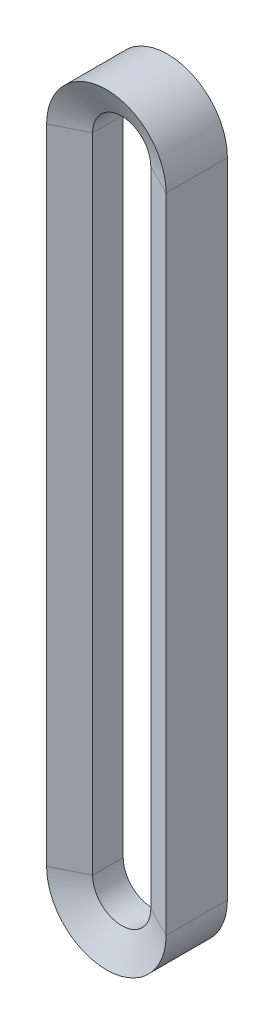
from build123d import *


with BuildPart() as part:
    # Sweep1: sweep along a path in Sketch2
    with BuildLine(Plane.XY) as sweep1_path:
        Line((12.065, 0), (12.065, -266.482137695))
        ThreePointArc((12.065, -266.482137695), (0, -278.547137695), (-12.065, -266.482137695))
        Line((-12.065, -266.482137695), (-12.065, 0))
        ThreePointArc((-12.065, 0), (0, 12.065), (12.065, 0))
    # Sketch3 → Sweep1 (sweep)
    with BuildSketch(Plane(origin=(0, 0, 0), x_dir=(1, 0, 0), z_dir=(0, 1, 0))):
        Polygon((12.065, -6.35), (12.065, 6.35), (24.765, 12.7), (24.765, -12.7), align=None)
    sweep(path=sweep1_path.line)


solid = part.part
